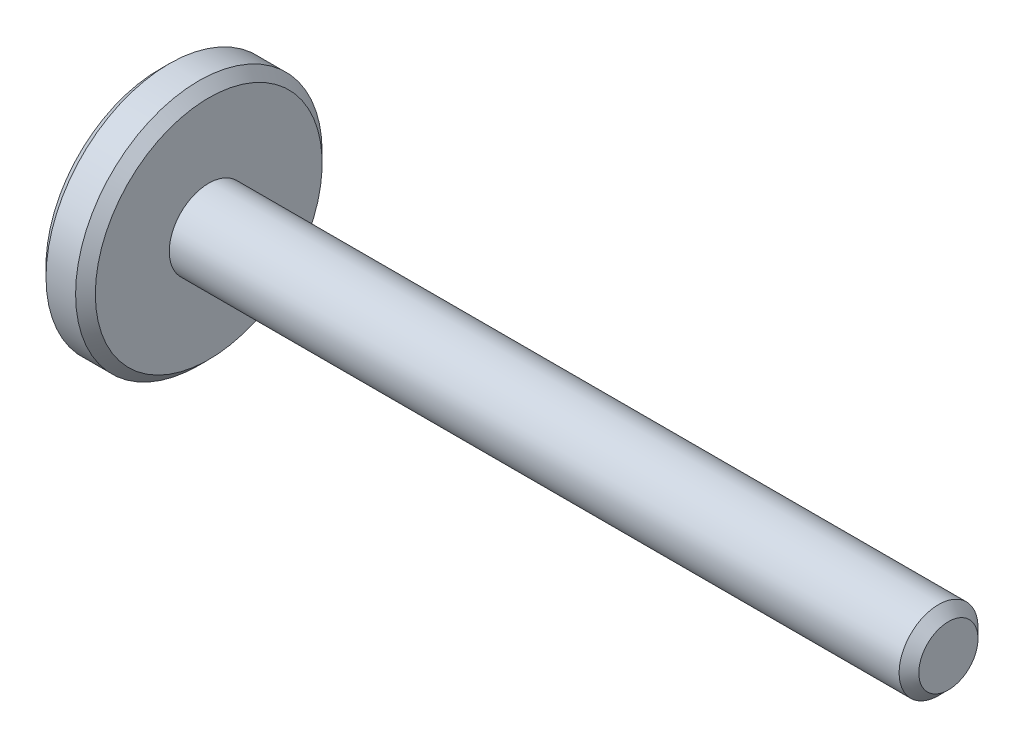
ISO-10303-21;
HEADER;
FILE_DESCRIPTION(('STEP AP214'),'2;1');
FILE_NAME('part.step','',(''),(''),'','','');
FILE_SCHEMA(('AUTOMOTIVE_DESIGN { 1 0 10303 214 1 1 1 1 }'));
ENDSEC;
DATA;
#1=APPLICATION_CONTEXT('core data for automotive mechanical design processes');
#2=APPLICATION_PROTOCOL_DEFINITION('international standard','automotive_design',2000,#1);
#3=PRODUCT_CONTEXT('',#1,'mechanical');
#4=PRODUCT('Part','Part','',(#3));
#5=PRODUCT_RELATED_PRODUCT_CATEGORY('part','',(#4));
#6=PRODUCT_DEFINITION_FORMATION('','',#4);
#7=PRODUCT_DEFINITION_CONTEXT('part definition',#1,'design');
#8=PRODUCT_DEFINITION('design','',#6,#7);
#9=PRODUCT_DEFINITION_SHAPE('','',#8);
#10=(LENGTH_UNIT() NAMED_UNIT(*) SI_UNIT(.MILLI.,.METRE.));
#11=(NAMED_UNIT(*) PLANE_ANGLE_UNIT() SI_UNIT($,.RADIAN.));
#12=(NAMED_UNIT(*) SI_UNIT($,.STERADIAN.) SOLID_ANGLE_UNIT());
#13=UNCERTAINTY_MEASURE_WITH_UNIT(LENGTH_MEASURE(1.E-05),#10,'distance_accuracy_value','');
#14=(GEOMETRIC_REPRESENTATION_CONTEXT(3) GLOBAL_UNCERTAINTY_ASSIGNED_CONTEXT((#13)) GLOBAL_UNIT_ASSIGNED_CONTEXT((#10,
#11,#12)) REPRESENTATION_CONTEXT('',''));
#15=CARTESIAN_POINT('',(0.,0.,0.));
#16=DIRECTION('',(0.,0.,1.));
#17=DIRECTION('',(1.,0.,0.));
#18=AXIS2_PLACEMENT_3D('',#15,#16,#17);
#19=CARTESIAN_POINT('',(0.,0.,0.));
#20=DIRECTION('',(1.,0.,0.));
#21=DIRECTION('',(0.,0.,-1.));
#22=AXIS2_PLACEMENT_3D('',#19,#20,#21);
#23=PLANE('',#22);
#24=CARTESIAN_POINT('',(0.,0.,0.));
#25=DIRECTION('',(1.,0.,0.));
#26=DIRECTION('',(0.,0.,-1.));
#27=AXIS2_PLACEMENT_3D('',#24,#25,#26);
#28=CIRCLE('',#27,11.5);
#29=CARTESIAN_POINT('',(0.,0.,-11.5));
#30=VERTEX_POINT('',#29);
#31=EDGE_CURVE('E43',#30,#30,#28,.F.);
#32=ORIENTED_EDGE('',*,*,#31,.T.);
#33=EDGE_LOOP('',(#32));
#34=FACE_BOUND('',#33,.T.);
#35=ADVANCED_FACE('F28',(#34),#23,.F.);
#36=CARTESIAN_POINT('',(-12.3201335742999,0.,0.));
#37=DIRECTION('',(-1.,0.,0.));
#38=DIRECTION('',(0.,0.,1.));
#39=AXIS2_PLACEMENT_3D('',#36,#37,#38);
#40=CYLINDRICAL_SURFACE('',#39,12.5);
#41=CARTESIAN_POINT('',(0.999999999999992,0.,0.));
#42=DIRECTION('',(1.,0.,0.));
#43=DIRECTION('',(0.,0.,-1.));
#44=AXIS2_PLACEMENT_3D('',#41,#42,#43);
#45=CIRCLE('',#44,12.5);
#46=CARTESIAN_POINT('',(0.999999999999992,0.,-12.5));
#47=VERTEX_POINT('',#46);
#48=EDGE_CURVE('E35',#47,#47,#45,.T.);
#49=ORIENTED_EDGE('',*,*,#48,.T.);
#50=EDGE_LOOP('',(#49));
#51=FACE_BOUND('',#50,.T.);
#52=CARTESIAN_POINT('',(3.99999999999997,0.,0.));
#53=DIRECTION('',(-1.,0.,0.));
#54=DIRECTION('',(0.,0.,1.));
#55=AXIS2_PLACEMENT_3D('',#52,#53,#54);
#56=CIRCLE('',#55,12.5);
#57=CARTESIAN_POINT('',(3.99999999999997,0.,12.5));
#58=VERTEX_POINT('',#57);
#59=EDGE_CURVE('E39',#58,#58,#56,.T.);
#60=ORIENTED_EDGE('',*,*,#59,.T.);
#61=EDGE_LOOP('',(#60));
#62=FACE_BOUND('',#61,.T.);
#63=ADVANCED_FACE('F72',(#51,#62),#40,.T.);
#64=CARTESIAN_POINT('',(5.,12.5,0.));
#65=DIRECTION('',(-1.,0.,0.));
#66=DIRECTION('',(0.,0.,1.));
#67=AXIS2_PLACEMENT_3D('',#64,#65,#66);
#68=PLANE('',#67);
#69=CARTESIAN_POINT('',(5.,0.,0.));
#70=DIRECTION('',(-1.,0.,0.));
#71=DIRECTION('',(0.,0.,1.));
#72=AXIS2_PLACEMENT_3D('',#69,#70,#71);
#73=CIRCLE('',#72,11.5);
#74=CARTESIAN_POINT('',(5.,0.,11.5));
#75=VERTEX_POINT('',#74);
#76=EDGE_CURVE('E10',#75,#75,#73,.F.);
#77=ORIENTED_EDGE('',*,*,#76,.T.);
#78=EDGE_LOOP('',(#77));
#79=FACE_BOUND('',#78,.T.);
#80=CARTESIAN_POINT('',(5.,0.,0.));
#81=DIRECTION('',(-1.,0.,0.));
#82=DIRECTION('',(0.,0.,1.));
#83=AXIS2_PLACEMENT_3D('',#80,#81,#82);
#84=CIRCLE('',#83,4.);
#85=CARTESIAN_POINT('',(5.,0.,4.));
#86=VERTEX_POINT('',#85);
#87=EDGE_CURVE('E54',#86,#86,#84,.T.);
#88=ORIENTED_EDGE('',*,*,#87,.T.);
#89=EDGE_LOOP('',(#88));
#90=FACE_BOUND('',#89,.T.);
#91=ADVANCED_FACE('F58',(#79,#90),#68,.F.);
#92=CARTESIAN_POINT('',(-12.3201335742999,0.,0.));
#93=DIRECTION('',(-1.,0.,0.));
#94=DIRECTION('',(0.,0.,1.));
#95=AXIS2_PLACEMENT_3D('',#92,#93,#94);
#96=CYLINDRICAL_SURFACE('',#95,4.);
#97=CARTESIAN_POINT('',(79.,0.,0.));
#98=DIRECTION('',(-1.,0.,0.));
#99=DIRECTION('',(0.,0.,1.));
#100=AXIS2_PLACEMENT_3D('',#97,#98,#99);
#101=CIRCLE('',#100,4.);
#102=CARTESIAN_POINT('',(79.,0.,4.));
#103=VERTEX_POINT('',#102);
#104=EDGE_CURVE('E51',#103,#103,#101,.T.);
#105=ORIENTED_EDGE('',*,*,#104,.T.);
#106=EDGE_LOOP('',(#105));
#107=FACE_BOUND('',#106,.T.);
#108=ORIENTED_EDGE('',*,*,#87,.F.);
#109=EDGE_LOOP('',(#108));
#110=FACE_BOUND('',#109,.T.);
#111=ADVANCED_FACE('F60',(#107,#110),#96,.T.);
#112=CARTESIAN_POINT('',(80.,4.00000000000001,0.));
#113=DIRECTION('',(-1.,0.,0.));
#114=DIRECTION('',(0.,0.,1.));
#115=AXIS2_PLACEMENT_3D('',#112,#113,#114);
#116=PLANE('',#115);
#117=CARTESIAN_POINT('',(80.,0.,0.));
#118=DIRECTION('',(-1.,0.,0.));
#119=DIRECTION('',(0.,0.,1.));
#120=AXIS2_PLACEMENT_3D('',#117,#118,#119);
#121=CIRCLE('',#120,3.00000000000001);
#122=CARTESIAN_POINT('',(80.,0.,3.00000000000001));
#123=VERTEX_POINT('',#122);
#124=EDGE_CURVE('E48',#123,#123,#121,.F.);
#125=ORIENTED_EDGE('',*,*,#124,.T.);
#126=EDGE_LOOP('',(#125));
#127=FACE_BOUND('',#126,.T.);
#128=ADVANCED_FACE('F62',(#127),#116,.F.);
#129=CARTESIAN_POINT('',(79.,0.,0.));
#130=DIRECTION('',(-1.,0.,0.));
#131=DIRECTION('',(0.,0.,1.));
#132=AXIS2_PLACEMENT_3D('',#129,#130,#131);
#133=CONICAL_SURFACE('',#132,4.,0.785398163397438);
#134=ORIENTED_EDGE('',*,*,#124,.F.);
#135=EDGE_LOOP('',(#134));
#136=FACE_BOUND('',#135,.T.);
#137=ORIENTED_EDGE('',*,*,#104,.F.);
#138=EDGE_LOOP('',(#137));
#139=FACE_BOUND('',#138,.T.);
#140=ADVANCED_FACE('F69',(#136,#139),#133,.T.);
#141=CARTESIAN_POINT('',(0.,0.,0.));
#142=DIRECTION('',(1.,0.,0.));
#143=DIRECTION('',(0.,0.,-1.));
#144=AXIS2_PLACEMENT_3D('',#141,#142,#143);
#145=CONICAL_SURFACE('',#144,11.5,0.785398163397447);
#146=ORIENTED_EDGE('',*,*,#48,.F.);
#147=EDGE_LOOP('',(#146));
#148=FACE_BOUND('',#147,.T.);
#149=ORIENTED_EDGE('',*,*,#31,.F.);
#150=EDGE_LOOP('',(#149));
#151=FACE_BOUND('',#150,.T.);
#152=ADVANCED_FACE('F83',(#148,#151),#145,.T.);
#153=CARTESIAN_POINT('',(3.99999999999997,0.,0.));
#154=DIRECTION('',(-1.,0.,0.));
#155=DIRECTION('',(0.,0.,1.));
#156=AXIS2_PLACEMENT_3D('',#153,#154,#155);
#157=CONICAL_SURFACE('',#156,12.5,0.785398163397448);
#158=ORIENTED_EDGE('',*,*,#76,.F.);
#159=EDGE_LOOP('',(#158));
#160=FACE_BOUND('',#159,.T.);
#161=ORIENTED_EDGE('',*,*,#59,.F.);
#162=EDGE_LOOP('',(#161));
#163=FACE_BOUND('',#162,.T.);
#164=ADVANCED_FACE('F30',(#160,#163),#157,.T.);
#165=CLOSED_SHELL('',(#35,#63,#91,#111,#128,#140,#152,#164));
#166=MANIFOLD_SOLID_BREP('B2',#165);
#167=ADVANCED_BREP_SHAPE_REPRESENTATION('',(#18,#166),#14);
#168=SHAPE_DEFINITION_REPRESENTATION(#9,#167);
ENDSEC;
END-ISO-10303-21;
